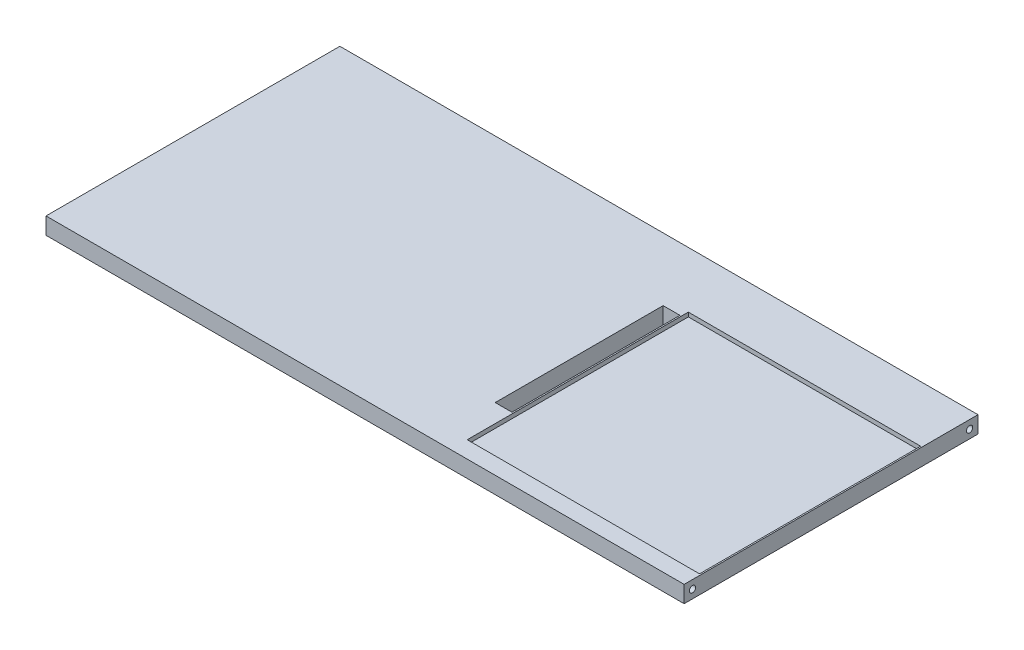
ISO-10303-21;
HEADER;
FILE_DESCRIPTION(('STEP AP214'),'2;1');
FILE_NAME('part.step','',(''),(''),'','','');
FILE_SCHEMA(('AUTOMOTIVE_DESIGN { 1 0 10303 214 1 1 1 1 }'));
ENDSEC;
DATA;
#1=APPLICATION_CONTEXT('core data for automotive mechanical design processes');
#2=APPLICATION_PROTOCOL_DEFINITION('international standard','automotive_design',2000,#1);
#3=PRODUCT_CONTEXT('',#1,'mechanical');
#4=PRODUCT('Part','Part','',(#3));
#5=PRODUCT_RELATED_PRODUCT_CATEGORY('part','',(#4));
#6=PRODUCT_DEFINITION_FORMATION('','',#4);
#7=PRODUCT_DEFINITION_CONTEXT('part definition',#1,'design');
#8=PRODUCT_DEFINITION('design','',#6,#7);
#9=PRODUCT_DEFINITION_SHAPE('','',#8);
#10=(LENGTH_UNIT() NAMED_UNIT(*) SI_UNIT(.MILLI.,.METRE.));
#11=(NAMED_UNIT(*) PLANE_ANGLE_UNIT() SI_UNIT($,.RADIAN.));
#12=(NAMED_UNIT(*) SI_UNIT($,.STERADIAN.) SOLID_ANGLE_UNIT());
#13=UNCERTAINTY_MEASURE_WITH_UNIT(LENGTH_MEASURE(1.E-05),#10,'distance_accuracy_value','');
#14=(GEOMETRIC_REPRESENTATION_CONTEXT(3) GLOBAL_UNCERTAINTY_ASSIGNED_CONTEXT((#13)) GLOBAL_UNIT_ASSIGNED_CONTEXT((#10,
#11,#12)) REPRESENTATION_CONTEXT('',''));
#15=CARTESIAN_POINT('',(0.,0.,0.));
#16=DIRECTION('',(0.,0.,1.));
#17=DIRECTION('',(1.,0.,0.));
#18=AXIS2_PLACEMENT_3D('',#15,#16,#17);
#19=CARTESIAN_POINT('',(0.,12.,0.));
#20=DIRECTION('',(0.,-1.,0.));
#21=DIRECTION('',(0.,0.,-1.));
#22=AXIS2_PLACEMENT_3D('',#19,#20,#21);
#23=PLANE('',#22);
#24=DIRECTION('',(0.,0.,-1.));
#25=VECTOR('',#24,1.);
#26=CARTESIAN_POINT('',(60.,12.,60.));
#27=LINE('',#26,#25);
#28=CARTESIAN_POINT('',(60.,12.,60.));
#29=VERTEX_POINT('',#28);
#30=CARTESIAN_POINT('',(60.,12.,-60.));
#31=VERTEX_POINT('',#30);
#32=EDGE_CURVE('E200',#29,#31,#27,.T.);
#33=ORIENTED_EDGE('',*,*,#32,.F.);
#34=DIRECTION('',(-1.,0.,0.));
#35=VECTOR('',#34,1.);
#36=CARTESIAN_POINT('',(60.,12.,60.));
#37=LINE('',#36,#35);
#38=CARTESIAN_POINT('',(48.,12.,60.));
#39=VERTEX_POINT('',#38);
#40=EDGE_CURVE('E215',#29,#39,#37,.T.);
#41=ORIENTED_EDGE('',*,*,#40,.T.);
#42=DIRECTION('',(0.,0.,-1.));
#43=VECTOR('',#42,1.);
#44=CARTESIAN_POINT('',(48.,12.,60.));
#45=LINE('',#44,#43);
#46=CARTESIAN_POINT('',(48.,12.,-60.));
#47=VERTEX_POINT('',#46);
#48=EDGE_CURVE('E194',#39,#47,#45,.T.);
#49=ORIENTED_EDGE('',*,*,#48,.T.);
#50=DIRECTION('',(-1.,0.,0.));
#51=VECTOR('',#50,1.);
#52=CARTESIAN_POINT('',(60.,12.,-60.));
#53=LINE('',#52,#51);
#54=EDGE_CURVE('E212',#31,#47,#53,.T.);
#55=ORIENTED_EDGE('',*,*,#54,.F.);
#56=EDGE_LOOP('',(#33,#41,#49,#55));
#57=FACE_BOUND('',#56,.T.);
#58=DIRECTION('',(0.,0.,1.));
#59=VECTOR('',#58,1.);
#60=CARTESIAN_POINT('',(-228.,12.,-105.));
#61=LINE('',#60,#59);
#62=CARTESIAN_POINT('',(-228.,12.,-105.));
#63=VERTEX_POINT('',#62);
#64=CARTESIAN_POINT('',(-228.,12.,105.));
#65=VERTEX_POINT('',#64);
#66=EDGE_CURVE('E223',#63,#65,#61,.T.);
#67=ORIENTED_EDGE('',*,*,#66,.T.);
#68=DIRECTION('',(1.,0.,0.));
#69=VECTOR('',#68,1.);
#70=CARTESIAN_POINT('',(228.,12.,105.));
#71=LINE('',#70,#69);
#72=CARTESIAN_POINT('',(228.,12.,105.));
#73=VERTEX_POINT('',#72);
#74=EDGE_CURVE('E226',#65,#73,#71,.T.);
#75=ORIENTED_EDGE('',*,*,#74,.T.);
#76=DIRECTION('',(0.,0.,-1.));
#77=VECTOR('',#76,1.);
#78=CARTESIAN_POINT('',(228.,12.,-105.));
#79=LINE('',#78,#77);
#80=CARTESIAN_POINT('',(228.,12.,-105.));
#81=VERTEX_POINT('',#80);
#82=EDGE_CURVE('E229',#73,#81,#79,.T.);
#83=ORIENTED_EDGE('',*,*,#82,.T.);
#84=DIRECTION('',(-1.,0.,0.));
#85=VECTOR('',#84,1.);
#86=CARTESIAN_POINT('',(228.,12.,-105.));
#87=LINE('',#86,#85);
#88=EDGE_CURVE('E231',#81,#63,#87,.T.);
#89=ORIENTED_EDGE('',*,*,#88,.T.);
#90=EDGE_LOOP('',(#67,#75,#83,#89));
#91=FACE_BOUND('',#90,.T.);
#92=DIRECTION('',(0.,0.,-1.));
#93=VECTOR('',#92,1.);
#94=CARTESIAN_POINT('',(61.,12.,93.));
#95=LINE('',#94,#93);
#96=CARTESIAN_POINT('',(61.,12.,93.));
#97=VERTEX_POINT('',#96);
#98=CARTESIAN_POINT('',(61.0000000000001,12.,-65.));
#99=VERTEX_POINT('',#98);
#100=EDGE_CURVE('E52',#97,#99,#95,.T.);
#101=ORIENTED_EDGE('',*,*,#100,.T.);
#102=DIRECTION('',(1.,0.,0.));
#103=VECTOR('',#102,1.);
#104=CARTESIAN_POINT('',(61.0000000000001,12.,-65.));
#105=LINE('',#104,#103);
#106=CARTESIAN_POINT('',(227.,12.,-65.));
#107=VERTEX_POINT('',#106);
#108=EDGE_CURVE('E175',#99,#107,#105,.T.);
#109=ORIENTED_EDGE('',*,*,#108,.T.);
#110=DIRECTION('',(0.,0.,1.));
#111=VECTOR('',#110,1.);
#112=CARTESIAN_POINT('',(227.,12.,93.));
#113=LINE('',#112,#111);
#114=CARTESIAN_POINT('',(227.,12.,93.));
#115=VERTEX_POINT('',#114);
#116=EDGE_CURVE('E178',#107,#115,#113,.T.);
#117=ORIENTED_EDGE('',*,*,#116,.T.);
#118=DIRECTION('',(-1.,0.,0.));
#119=VECTOR('',#118,1.);
#120=CARTESIAN_POINT('',(61.,12.,93.));
#121=LINE('',#120,#119);
#122=EDGE_CURVE('E167',#115,#97,#121,.T.);
#123=ORIENTED_EDGE('',*,*,#122,.T.);
#124=EDGE_LOOP('',(#101,#109,#117,#123));
#125=FACE_BOUND('',#124,.T.);
#126=ADVANCED_FACE('F35',(#57,#91,#125),#23,.F.);
#127=CARTESIAN_POINT('',(0.,0.,0.));
#128=DIRECTION('',(0.,-1.,0.));
#129=DIRECTION('',(0.,0.,-1.));
#130=AXIS2_PLACEMENT_3D('',#127,#128,#129);
#131=PLANE('',#130);
#132=DIRECTION('',(0.,0.,1.));
#133=VECTOR('',#132,1.);
#134=CARTESIAN_POINT('',(-228.,0.,-105.));
#135=LINE('',#134,#133);
#136=CARTESIAN_POINT('',(-228.,0.,-105.));
#137=VERTEX_POINT('',#136);
#138=CARTESIAN_POINT('',(-228.,0.,105.));
#139=VERTEX_POINT('',#138);
#140=EDGE_CURVE('E214',#137,#139,#135,.T.);
#141=ORIENTED_EDGE('',*,*,#140,.F.);
#142=DIRECTION('',(-1.,0.,0.));
#143=VECTOR('',#142,1.);
#144=CARTESIAN_POINT('',(228.,0.,-105.));
#145=LINE('',#144,#143);
#146=CARTESIAN_POINT('',(228.,0.,-105.));
#147=VERTEX_POINT('',#146);
#148=EDGE_CURVE('E227',#147,#137,#145,.T.);
#149=ORIENTED_EDGE('',*,*,#148,.F.);
#150=DIRECTION('',(0.,0.,-1.));
#151=VECTOR('',#150,1.);
#152=CARTESIAN_POINT('',(228.,0.,-105.));
#153=LINE('',#152,#151);
#154=CARTESIAN_POINT('',(228.,0.,105.));
#155=VERTEX_POINT('',#154);
#156=EDGE_CURVE('E238',#155,#147,#153,.T.);
#157=ORIENTED_EDGE('',*,*,#156,.F.);
#158=DIRECTION('',(1.,0.,0.));
#159=VECTOR('',#158,1.);
#160=CARTESIAN_POINT('',(228.,0.,105.));
#161=LINE('',#160,#159);
#162=EDGE_CURVE('E236',#139,#155,#161,.T.);
#163=ORIENTED_EDGE('',*,*,#162,.F.);
#164=EDGE_LOOP('',(#141,#149,#157,#163));
#165=FACE_BOUND('',#164,.T.);
#166=DIRECTION('',(-1.,0.,0.));
#167=VECTOR('',#166,1.);
#168=CARTESIAN_POINT('',(60.,0.,60.));
#169=LINE('',#168,#167);
#170=CARTESIAN_POINT('',(60.,0.,60.));
#171=VERTEX_POINT('',#170);
#172=CARTESIAN_POINT('',(48.,0.,60.));
#173=VERTEX_POINT('',#172);
#174=EDGE_CURVE('E218',#171,#173,#169,.T.);
#175=ORIENTED_EDGE('',*,*,#174,.F.);
#176=DIRECTION('',(0.,0.,1.));
#177=VECTOR('',#176,1.);
#178=CARTESIAN_POINT('',(60.,0.,-60.));
#179=LINE('',#178,#177);
#180=CARTESIAN_POINT('',(60.,0.,-60.));
#181=VERTEX_POINT('',#180);
#182=EDGE_CURVE('E193',#181,#171,#179,.T.);
#183=ORIENTED_EDGE('',*,*,#182,.F.);
#184=DIRECTION('',(-1.,0.,0.));
#185=VECTOR('',#184,1.);
#186=CARTESIAN_POINT('',(60.,0.,-60.));
#187=LINE('',#186,#185);
#188=CARTESIAN_POINT('',(48.,0.,-60.));
#189=VERTEX_POINT('',#188);
#190=EDGE_CURVE('E203',#181,#189,#187,.T.);
#191=ORIENTED_EDGE('',*,*,#190,.T.);
#192=DIRECTION('',(0.,0.,1.));
#193=VECTOR('',#192,1.);
#194=CARTESIAN_POINT('',(48.,0.,-60.));
#195=LINE('',#194,#193);
#196=EDGE_CURVE('E205',#189,#173,#195,.T.);
#197=ORIENTED_EDGE('',*,*,#196,.T.);
#198=EDGE_LOOP('',(#175,#183,#191,#197));
#199=FACE_BOUND('',#198,.T.);
#200=ADVANCED_FACE('F274',(#165,#199),#131,.T.);
#201=CARTESIAN_POINT('',(-228.,12.,-105.));
#202=DIRECTION('',(1.,0.,0.));
#203=DIRECTION('',(0.,0.,-1.));
#204=AXIS2_PLACEMENT_3D('',#201,#202,#203);
#205=PLANE('',#204);
#206=CARTESIAN_POINT('',(-228.,6.,-98.9999999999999));
#207=DIRECTION('',(1.,0.,0.));
#208=DIRECTION('',(0.,0.,-1.));
#209=AXIS2_PLACEMENT_3D('',#206,#207,#208);
#210=CIRCLE('',#209,2.25);
#211=CARTESIAN_POINT('',(-228.,6.,-101.25));
#212=VERTEX_POINT('',#211);
#213=EDGE_CURVE('E158',#212,#212,#210,.T.);
#214=ORIENTED_EDGE('',*,*,#213,.T.);
#215=EDGE_LOOP('',(#214));
#216=FACE_BOUND('',#215,.T.);
#217=CARTESIAN_POINT('',(-228.,6.,99.));
#218=DIRECTION('',(1.,0.,0.));
#219=DIRECTION('',(0.,0.,-1.));
#220=AXIS2_PLACEMENT_3D('',#217,#218,#219);
#221=CIRCLE('',#220,2.25);
#222=CARTESIAN_POINT('',(-228.,6.,96.75));
#223=VERTEX_POINT('',#222);
#224=EDGE_CURVE('E162',#223,#223,#221,.T.);
#225=ORIENTED_EDGE('',*,*,#224,.T.);
#226=EDGE_LOOP('',(#225));
#227=FACE_BOUND('',#226,.T.);
#228=ORIENTED_EDGE('',*,*,#140,.T.);
#229=DIRECTION('',(0.,-1.,0.));
#230=VECTOR('',#229,1.);
#231=CARTESIAN_POINT('',(-228.,12.,105.));
#232=LINE('',#231,#230);
#233=EDGE_CURVE('E11',#65,#139,#232,.T.);
#234=ORIENTED_EDGE('',*,*,#233,.F.);
#235=ORIENTED_EDGE('',*,*,#66,.F.);
#236=DIRECTION('',(0.,-1.,0.));
#237=VECTOR('',#236,1.);
#238=CARTESIAN_POINT('',(-228.,12.,-105.));
#239=LINE('',#238,#237);
#240=EDGE_CURVE('E233',#63,#137,#239,.T.);
#241=ORIENTED_EDGE('',*,*,#240,.T.);
#242=EDGE_LOOP('',(#228,#234,#235,#241));
#243=FACE_BOUND('',#242,.T.);
#244=ADVANCED_FACE('F37',(#216,#227,#243),#205,.F.);
#245=CARTESIAN_POINT('',(228.,12.,105.));
#246=DIRECTION('',(0.,0.,-1.));
#247=DIRECTION('',(-1.,0.,0.));
#248=AXIS2_PLACEMENT_3D('',#245,#246,#247);
#249=PLANE('',#248);
#250=ORIENTED_EDGE('',*,*,#162,.T.);
#251=DIRECTION('',(0.,-1.,0.));
#252=VECTOR('',#251,1.);
#253=CARTESIAN_POINT('',(228.,12.,105.));
#254=LINE('',#253,#252);
#255=EDGE_CURVE('E44',#73,#155,#254,.T.);
#256=ORIENTED_EDGE('',*,*,#255,.F.);
#257=ORIENTED_EDGE('',*,*,#74,.F.);
#258=ORIENTED_EDGE('',*,*,#233,.T.);
#259=EDGE_LOOP('',(#250,#256,#257,#258));
#260=FACE_BOUND('',#259,.T.);
#261=ADVANCED_FACE('F293',(#260),#249,.F.);
#262=CARTESIAN_POINT('',(228.,12.,-105.));
#263=DIRECTION('',(-1.,0.,0.));
#264=DIRECTION('',(0.,0.,1.));
#265=AXIS2_PLACEMENT_3D('',#262,#263,#264);
#266=PLANE('',#265);
#267=CARTESIAN_POINT('',(228.,6.,98.9999999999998));
#268=DIRECTION('',(-1.,0.,0.));
#269=DIRECTION('',(0.,0.,1.));
#270=AXIS2_PLACEMENT_3D('',#267,#268,#269);
#271=CIRCLE('',#270,2.25);
#272=CARTESIAN_POINT('',(228.,6.,101.25));
#273=VERTEX_POINT('',#272);
#274=EDGE_CURVE('E39',#273,#273,#271,.T.);
#275=ORIENTED_EDGE('',*,*,#274,.T.);
#276=EDGE_LOOP('',(#275));
#277=FACE_BOUND('',#276,.T.);
#278=CARTESIAN_POINT('',(228.,6.,-99.0000000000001));
#279=DIRECTION('',(-1.,0.,0.));
#280=DIRECTION('',(0.,0.,1.));
#281=AXIS2_PLACEMENT_3D('',#278,#279,#280);
#282=CIRCLE('',#281,2.25);
#283=CARTESIAN_POINT('',(228.,6.,-96.7500000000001));
#284=VERTEX_POINT('',#283);
#285=EDGE_CURVE('E154',#284,#284,#282,.T.);
#286=ORIENTED_EDGE('',*,*,#285,.T.);
#287=EDGE_LOOP('',(#286));
#288=FACE_BOUND('',#287,.T.);
#289=ORIENTED_EDGE('',*,*,#156,.T.);
#290=DIRECTION('',(0.,-1.,0.));
#291=VECTOR('',#290,1.);
#292=CARTESIAN_POINT('',(228.,12.,-105.));
#293=LINE('',#292,#291);
#294=EDGE_CURVE('E243',#81,#147,#293,.T.);
#295=ORIENTED_EDGE('',*,*,#294,.F.);
#296=ORIENTED_EDGE('',*,*,#82,.F.);
#297=ORIENTED_EDGE('',*,*,#255,.T.);
#298=EDGE_LOOP('',(#289,#295,#296,#297));
#299=FACE_BOUND('',#298,.T.);
#300=ADVANCED_FACE('F254',(#277,#288,#299),#266,.F.);
#301=CARTESIAN_POINT('',(228.,12.,-105.));
#302=DIRECTION('',(0.,0.,1.));
#303=DIRECTION('',(1.,0.,0.));
#304=AXIS2_PLACEMENT_3D('',#301,#302,#303);
#305=PLANE('',#304);
#306=ORIENTED_EDGE('',*,*,#148,.T.);
#307=ORIENTED_EDGE('',*,*,#240,.F.);
#308=ORIENTED_EDGE('',*,*,#88,.F.);
#309=ORIENTED_EDGE('',*,*,#294,.T.);
#310=EDGE_LOOP('',(#306,#307,#308,#309));
#311=FACE_BOUND('',#310,.T.);
#312=ADVANCED_FACE('F288',(#311),#305,.F.);
#313=CARTESIAN_POINT('',(60.,12.,-60.));
#314=DIRECTION('',(0.,0.,-1.));
#315=DIRECTION('',(-1.,0.,0.));
#316=AXIS2_PLACEMENT_3D('',#313,#314,#315);
#317=PLANE('',#316);
#318=DIRECTION('',(0.,-1.,0.));
#319=VECTOR('',#318,1.);
#320=CARTESIAN_POINT('',(48.,12.,-60.));
#321=LINE('',#320,#319);
#322=EDGE_CURVE('E60',#47,#189,#321,.T.);
#323=ORIENTED_EDGE('',*,*,#322,.T.);
#324=ORIENTED_EDGE('',*,*,#190,.F.);
#325=DIRECTION('',(0.,-1.,0.));
#326=VECTOR('',#325,1.);
#327=CARTESIAN_POINT('',(60.,12.,-60.));
#328=LINE('',#327,#326);
#329=EDGE_CURVE('E190',#31,#181,#328,.T.);
#330=ORIENTED_EDGE('',*,*,#329,.F.);
#331=ORIENTED_EDGE('',*,*,#54,.T.);
#332=EDGE_LOOP('',(#323,#324,#330,#331));
#333=FACE_BOUND('',#332,.T.);
#334=ADVANCED_FACE('F285',(#333),#317,.F.);
#335=CARTESIAN_POINT('',(60.,0.,60.));
#336=DIRECTION('',(0.,0.,1.));
#337=DIRECTION('',(1.,0.,0.));
#338=AXIS2_PLACEMENT_3D('',#335,#336,#337);
#339=PLANE('',#338);
#340=DIRECTION('',(0.,1.,0.));
#341=VECTOR('',#340,1.);
#342=CARTESIAN_POINT('',(48.,0.,60.));
#343=LINE('',#342,#341);
#344=EDGE_CURVE('E208',#173,#39,#343,.T.);
#345=ORIENTED_EDGE('',*,*,#344,.T.);
#346=ORIENTED_EDGE('',*,*,#40,.F.);
#347=DIRECTION('',(0.,1.,0.));
#348=VECTOR('',#347,1.);
#349=CARTESIAN_POINT('',(60.,0.,60.));
#350=LINE('',#349,#348);
#351=EDGE_CURVE('E197',#171,#29,#350,.T.);
#352=ORIENTED_EDGE('',*,*,#351,.F.);
#353=ORIENTED_EDGE('',*,*,#174,.T.);
#354=EDGE_LOOP('',(#345,#346,#352,#353));
#355=FACE_BOUND('',#354,.T.);
#356=ADVANCED_FACE('F347',(#355),#339,.F.);
#357=CARTESIAN_POINT('',(60.,0.,0.));
#358=DIRECTION('',(-1.,0.,0.));
#359=DIRECTION('',(0.,0.,1.));
#360=AXIS2_PLACEMENT_3D('',#357,#358,#359);
#361=PLANE('',#360);
#362=ORIENTED_EDGE('',*,*,#329,.T.);
#363=ORIENTED_EDGE('',*,*,#182,.T.);
#364=ORIENTED_EDGE('',*,*,#351,.T.);
#365=ORIENTED_EDGE('',*,*,#32,.T.);
#366=EDGE_LOOP('',(#362,#363,#364,#365));
#367=FACE_BOUND('',#366,.T.);
#368=ADVANCED_FACE('F344',(#367),#361,.T.);
#369=CARTESIAN_POINT('',(48.,0.,0.));
#370=DIRECTION('',(-1.,0.,0.));
#371=DIRECTION('',(0.,0.,1.));
#372=AXIS2_PLACEMENT_3D('',#369,#370,#371);
#373=PLANE('',#372);
#374=ORIENTED_EDGE('',*,*,#322,.F.);
#375=ORIENTED_EDGE('',*,*,#48,.F.);
#376=ORIENTED_EDGE('',*,*,#344,.F.);
#377=ORIENTED_EDGE('',*,*,#196,.F.);
#378=EDGE_LOOP('',(#374,#375,#376,#377));
#379=FACE_BOUND('',#378,.T.);
#380=ADVANCED_FACE('F343',(#379),#373,.F.);
#381=CARTESIAN_POINT('',(61.,9.,93.));
#382=DIRECTION('',(1.,0.,0.));
#383=DIRECTION('',(0.,0.,-1.));
#384=AXIS2_PLACEMENT_3D('',#381,#382,#383);
#385=PLANE('',#384);
#386=ORIENTED_EDGE('',*,*,#100,.F.);
#387=DIRECTION('',(0.,1.,0.));
#388=VECTOR('',#387,1.);
#389=CARTESIAN_POINT('',(61.,9.,93.));
#390=LINE('',#389,#388);
#391=CARTESIAN_POINT('',(61.,9.,93.));
#392=VERTEX_POINT('',#391);
#393=EDGE_CURVE('E173',#392,#97,#390,.T.);
#394=ORIENTED_EDGE('',*,*,#393,.F.);
#395=DIRECTION('',(0.,0.,-1.));
#396=VECTOR('',#395,1.);
#397=CARTESIAN_POINT('',(61.,9.,93.));
#398=LINE('',#397,#396);
#399=CARTESIAN_POINT('',(61.0000000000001,9.,-65.));
#400=VERTEX_POINT('',#399);
#401=EDGE_CURVE('E163',#392,#400,#398,.T.);
#402=ORIENTED_EDGE('',*,*,#401,.T.);
#403=DIRECTION('',(0.,1.,0.));
#404=VECTOR('',#403,1.);
#405=CARTESIAN_POINT('',(61.0000000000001,9.,-65.));
#406=LINE('',#405,#404);
#407=EDGE_CURVE('E188',#400,#99,#406,.T.);
#408=ORIENTED_EDGE('',*,*,#407,.T.);
#409=EDGE_LOOP('',(#386,#394,#402,#408));
#410=FACE_BOUND('',#409,.T.);
#411=ADVANCED_FACE('F321',(#410),#385,.T.);
#412=CARTESIAN_POINT('',(61.0000000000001,9.,-65.));
#413=DIRECTION('',(0.,0.,1.));
#414=DIRECTION('',(1.,0.,0.));
#415=AXIS2_PLACEMENT_3D('',#412,#413,#414);
#416=PLANE('',#415);
#417=ORIENTED_EDGE('',*,*,#108,.F.);
#418=ORIENTED_EDGE('',*,*,#407,.F.);
#419=DIRECTION('',(1.,0.,0.));
#420=VECTOR('',#419,1.);
#421=CARTESIAN_POINT('',(61.0000000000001,9.,-65.));
#422=LINE('',#421,#420);
#423=CARTESIAN_POINT('',(227.,9.,-65.));
#424=VERTEX_POINT('',#423);
#425=EDGE_CURVE('E166',#400,#424,#422,.T.);
#426=ORIENTED_EDGE('',*,*,#425,.T.);
#427=DIRECTION('',(0.,1.,0.));
#428=VECTOR('',#427,1.);
#429=CARTESIAN_POINT('',(227.,9.,-65.));
#430=LINE('',#429,#428);
#431=EDGE_CURVE('E186',#424,#107,#430,.T.);
#432=ORIENTED_EDGE('',*,*,#431,.T.);
#433=EDGE_LOOP('',(#417,#418,#426,#432));
#434=FACE_BOUND('',#433,.T.);
#435=ADVANCED_FACE('F328',(#434),#416,.T.);
#436=CARTESIAN_POINT('',(227.,9.,93.));
#437=DIRECTION('',(-1.,0.,0.));
#438=DIRECTION('',(0.,0.,1.));
#439=AXIS2_PLACEMENT_3D('',#436,#437,#438);
#440=PLANE('',#439);
#441=ORIENTED_EDGE('',*,*,#116,.F.);
#442=ORIENTED_EDGE('',*,*,#431,.F.);
#443=DIRECTION('',(0.,0.,1.));
#444=VECTOR('',#443,1.);
#445=CARTESIAN_POINT('',(227.,9.,93.));
#446=LINE('',#445,#444);
#447=CARTESIAN_POINT('',(227.,9.,93.));
#448=VERTEX_POINT('',#447);
#449=EDGE_CURVE('E169',#424,#448,#446,.T.);
#450=ORIENTED_EDGE('',*,*,#449,.T.);
#451=DIRECTION('',(0.,1.,0.));
#452=VECTOR('',#451,1.);
#453=CARTESIAN_POINT('',(227.,9.,93.));
#454=LINE('',#453,#452);
#455=EDGE_CURVE('E184',#448,#115,#454,.T.);
#456=ORIENTED_EDGE('',*,*,#455,.T.);
#457=EDGE_LOOP('',(#441,#442,#450,#456));
#458=FACE_BOUND('',#457,.T.);
#459=ADVANCED_FACE('F330',(#458),#440,.T.);
#460=CARTESIAN_POINT('',(61.,9.,93.));
#461=DIRECTION('',(0.,0.,-1.));
#462=DIRECTION('',(-1.,0.,0.));
#463=AXIS2_PLACEMENT_3D('',#460,#461,#462);
#464=PLANE('',#463);
#465=ORIENTED_EDGE('',*,*,#122,.F.);
#466=ORIENTED_EDGE('',*,*,#455,.F.);
#467=DIRECTION('',(-1.,0.,0.));
#468=VECTOR('',#467,1.);
#469=CARTESIAN_POINT('',(61.,9.,93.));
#470=LINE('',#469,#468);
#471=EDGE_CURVE('E171',#448,#392,#470,.T.);
#472=ORIENTED_EDGE('',*,*,#471,.T.);
#473=ORIENTED_EDGE('',*,*,#393,.T.);
#474=EDGE_LOOP('',(#465,#466,#472,#473));
#475=FACE_BOUND('',#474,.T.);
#476=ADVANCED_FACE('F318',(#475),#464,.T.);
#477=CARTESIAN_POINT('',(0.,9.,0.));
#478=DIRECTION('',(0.,-1.,0.));
#479=DIRECTION('',(0.,0.,-1.));
#480=AXIS2_PLACEMENT_3D('',#477,#478,#479);
#481=PLANE('',#480);
#482=ORIENTED_EDGE('',*,*,#401,.F.);
#483=ORIENTED_EDGE('',*,*,#471,.F.);
#484=ORIENTED_EDGE('',*,*,#449,.F.);
#485=ORIENTED_EDGE('',*,*,#425,.F.);
#486=EDGE_LOOP('',(#482,#483,#484,#485));
#487=FACE_BOUND('',#486,.T.);
#488=ADVANCED_FACE('F324',(#487),#481,.F.);
#489=CARTESIAN_POINT('',(-240.,6.,99.));
#490=DIRECTION('',(-1.,0.,0.));
#491=DIRECTION('',(0.,0.,1.));
#492=AXIS2_PLACEMENT_3D('',#489,#490,#491);
#493=CYLINDRICAL_SURFACE('',#492,2.25);
#494=CARTESIAN_POINT('',(-211.351936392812,6.,99.));
#495=DIRECTION('',(-1.,0.,0.));
#496=DIRECTION('',(0.,0.,1.));
#497=AXIS2_PLACEMENT_3D('',#494,#495,#496);
#498=CIRCLE('',#497,2.24999999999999);
#499=CARTESIAN_POINT('',(-211.351936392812,6.,101.25));
#500=VERTEX_POINT('',#499);
#501=EDGE_CURVE('E159',#500,#500,#498,.T.);
#502=ORIENTED_EDGE('',*,*,#501,.F.);
#503=EDGE_LOOP('',(#502));
#504=FACE_BOUND('',#503,.T.);
#505=ORIENTED_EDGE('',*,*,#224,.F.);
#506=EDGE_LOOP('',(#505));
#507=FACE_BOUND('',#506,.T.);
#508=ADVANCED_FACE('F421',(#504,#507),#493,.F.);
#509=CARTESIAN_POINT('',(-211.351936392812,6.,99.));
#510=DIRECTION('',(-1.,0.,0.));
#511=DIRECTION('',(0.,0.,1.));
#512=AXIS2_PLACEMENT_3D('',#509,#510,#511);
#513=CONICAL_SURFACE('',#512,2.24999999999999,1.02974425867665);
#514=CARTESIAN_POINT('',(-210.,5.99999999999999,99.));
#515=VERTEX_POINT('',#514);
#516=VERTEX_LOOP('',#515);
#517=FACE_BOUND('',#516,.T.);
#518=ORIENTED_EDGE('',*,*,#501,.T.);
#519=EDGE_LOOP('',(#518));
#520=FACE_BOUND('',#519,.T.);
#521=ADVANCED_FACE('F412',(#517,#520),#513,.F.);
#522=CARTESIAN_POINT('',(-240.,6.,-98.9999999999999));
#523=DIRECTION('',(-1.,0.,0.));
#524=DIRECTION('',(0.,0.,1.));
#525=AXIS2_PLACEMENT_3D('',#522,#523,#524);
#526=CYLINDRICAL_SURFACE('',#525,2.25);
#527=CARTESIAN_POINT('',(-211.351936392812,6.,-98.9999999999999));
#528=DIRECTION('',(-1.,0.,0.));
#529=DIRECTION('',(0.,0.,1.));
#530=AXIS2_PLACEMENT_3D('',#527,#528,#529);
#531=CIRCLE('',#530,2.24999999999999);
#532=CARTESIAN_POINT('',(-211.351936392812,6.,-96.7499999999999));
#533=VERTEX_POINT('',#532);
#534=EDGE_CURVE('E155',#533,#533,#531,.T.);
#535=ORIENTED_EDGE('',*,*,#534,.F.);
#536=EDGE_LOOP('',(#535));
#537=FACE_BOUND('',#536,.T.);
#538=ORIENTED_EDGE('',*,*,#213,.F.);
#539=EDGE_LOOP('',(#538));
#540=FACE_BOUND('',#539,.T.);
#541=ADVANCED_FACE('F269',(#537,#540),#526,.F.);
#542=CARTESIAN_POINT('',(-211.351936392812,6.,-98.9999999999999));
#543=DIRECTION('',(-1.,0.,0.));
#544=DIRECTION('',(0.,0.,1.));
#545=AXIS2_PLACEMENT_3D('',#542,#543,#544);
#546=CONICAL_SURFACE('',#545,2.24999999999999,1.02974425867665);
#547=CARTESIAN_POINT('',(-210.,5.99999999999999,-98.9999999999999));
#548=VERTEX_POINT('',#547);
#549=VERTEX_LOOP('',#548);
#550=FACE_BOUND('',#549,.T.);
#551=ORIENTED_EDGE('',*,*,#534,.T.);
#552=EDGE_LOOP('',(#551));
#553=FACE_BOUND('',#552,.T.);
#554=ADVANCED_FACE('F260',(#550,#553),#546,.F.);
#555=CARTESIAN_POINT('',(240.,6.,-99.0000000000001));
#556=DIRECTION('',(1.,0.,0.));
#557=DIRECTION('',(0.,0.,-1.));
#558=AXIS2_PLACEMENT_3D('',#555,#556,#557);
#559=CYLINDRICAL_SURFACE('',#558,2.25);
#560=CARTESIAN_POINT('',(211.351936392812,6.,-99.0000000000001));
#561=DIRECTION('',(1.,0.,0.));
#562=DIRECTION('',(0.,0.,-1.));
#563=AXIS2_PLACEMENT_3D('',#560,#561,#562);
#564=CIRCLE('',#563,2.24999999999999);
#565=CARTESIAN_POINT('',(211.351936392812,6.,-101.25));
#566=VERTEX_POINT('',#565);
#567=EDGE_CURVE('E150',#566,#566,#564,.T.);
#568=ORIENTED_EDGE('',*,*,#567,.F.);
#569=EDGE_LOOP('',(#568));
#570=FACE_BOUND('',#569,.T.);
#571=ORIENTED_EDGE('',*,*,#285,.F.);
#572=EDGE_LOOP('',(#571));
#573=FACE_BOUND('',#572,.T.);
#574=ADVANCED_FACE('F257',(#570,#573),#559,.F.);
#575=CARTESIAN_POINT('',(211.351936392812,6.,-99.0000000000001));
#576=DIRECTION('',(1.,0.,0.));
#577=DIRECTION('',(0.,0.,-1.));
#578=AXIS2_PLACEMENT_3D('',#575,#576,#577);
#579=CONICAL_SURFACE('',#578,2.24999999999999,1.02974425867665);
#580=CARTESIAN_POINT('',(210.,5.99999999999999,-99.0000000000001));
#581=VERTEX_POINT('',#580);
#582=VERTEX_LOOP('',#581);
#583=FACE_BOUND('',#582,.T.);
#584=ORIENTED_EDGE('',*,*,#567,.T.);
#585=EDGE_LOOP('',(#584));
#586=FACE_BOUND('',#585,.T.);
#587=ADVANCED_FACE('F259',(#583,#586),#579,.F.);
#588=CARTESIAN_POINT('',(240.,6.,98.9999999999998));
#589=DIRECTION('',(1.,0.,0.));
#590=DIRECTION('',(0.,0.,-1.));
#591=AXIS2_PLACEMENT_3D('',#588,#589,#590);
#592=CYLINDRICAL_SURFACE('',#591,2.25);
#593=CARTESIAN_POINT('',(211.351936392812,6.,98.9999999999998));
#594=DIRECTION('',(1.,0.,0.));
#595=DIRECTION('',(0.,0.,-1.));
#596=AXIS2_PLACEMENT_3D('',#593,#594,#595);
#597=CIRCLE('',#596,2.24999999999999);
#598=CARTESIAN_POINT('',(211.351936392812,6.,96.7499999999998));
#599=VERTEX_POINT('',#598);
#600=EDGE_CURVE('E146',#599,#599,#597,.T.);
#601=ORIENTED_EDGE('',*,*,#600,.F.);
#602=EDGE_LOOP('',(#601));
#603=FACE_BOUND('',#602,.T.);
#604=ORIENTED_EDGE('',*,*,#274,.F.);
#605=EDGE_LOOP('',(#604));
#606=FACE_BOUND('',#605,.T.);
#607=ADVANCED_FACE('F142',(#603,#606),#592,.F.);
#608=CARTESIAN_POINT('',(211.351936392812,6.,98.9999999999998));
#609=DIRECTION('',(1.,0.,0.));
#610=DIRECTION('',(0.,0.,-1.));
#611=AXIS2_PLACEMENT_3D('',#608,#609,#610);
#612=CONICAL_SURFACE('',#611,2.24999999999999,1.02974425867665);
#613=CARTESIAN_POINT('',(210.,5.99999999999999,98.9999999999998));
#614=VERTEX_POINT('',#613);
#615=VERTEX_LOOP('',#614);
#616=FACE_BOUND('',#615,.T.);
#617=ORIENTED_EDGE('',*,*,#600,.T.);
#618=EDGE_LOOP('',(#617));
#619=FACE_BOUND('',#618,.T.);
#620=ADVANCED_FACE('F139',(#616,#619),#612,.F.);
#621=CLOSED_SHELL('',(#126,#200,#244,#261,#300,#312,#334,#356,#368,#380,#411,#435,#459,#476,
#488,#508,#521,#541,#554,#574,#587,#607,#620));
#622=MANIFOLD_SOLID_BREP('B2',#621);
#623=ADVANCED_BREP_SHAPE_REPRESENTATION('',(#18,#622),#14);
#624=SHAPE_DEFINITION_REPRESENTATION(#9,#623);
ENDSEC;
END-ISO-10303-21;
